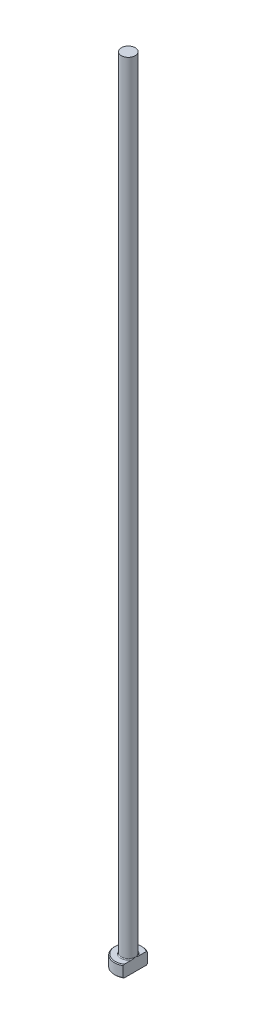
from build123d import *
from build123d.topology import SkipClean

# Parameters (mm, degrees)
CHAMFER1_SIZE = 0.2
FILLET1_R     = 0.2
KEY_DEPTH     = 201.061240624


with BuildPart() as part:
    # Sketch1 → Revolve1 (revolve)
    with BuildSketch(Plane.XY, mode=Mode.PRIVATE) as revolve1_sk:
        Polygon((0, 0), (-3.5, 0), (-3.5, 3), (-1.75, 3), (-1.75, 200), (0, 200), align=None)
    revolve(revolve1_sk.sketch.rotate(Axis((0, 259.958771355, 0), (0, -1, 0)), 270), axis=Axis((0, 259.958771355, 0), (0, -1, 0)))

    # Chamfer1
    chamfer1_edges = [part.edges().sort_by_distance(p)[0] for p in [
        (0, 3, -3.5),
        (0, 0, -3.5),
    ]]
    chamfer(chamfer1_edges, length=CHAMFER1_SIZE)

    # Fillet1
    fillet1_edges = [part.edges().sort_by_distance(p)[0] for p in [
        (0, 3, -1.75),
    ]]
    fillet(fillet1_edges, radius=FILLET1_R)

    # Sketch2 → KEY (cut, through all)
    with SkipClean():  # the faces are left unmerged after this step: merging them gives an invalid solid
        with BuildSketch(Plane(origin=(0, 0, 0), x_dir=(1, 0, 0), z_dir=(0, 1, 0))):
            with BuildLine():
                Line((1.75, 3.031088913), (1.75, -3.031088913))
                ThreePointArc((1.75, -3.031088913), (3.5, 0), (1.75, 3.031088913))
            make_face()
        extrude(amount=KEY_DEPTH, mode=Mode.SUBTRACT)


solid = part.part
